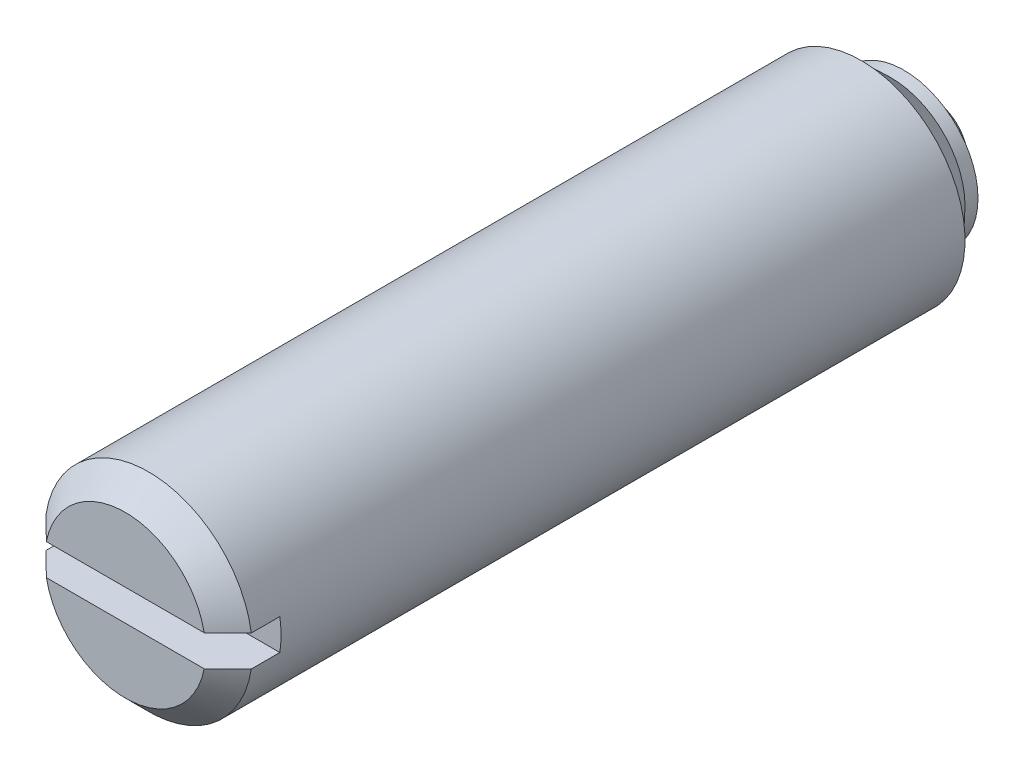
ISO-10303-21;
HEADER;
FILE_DESCRIPTION(('STEP AP214'),'2;1');
FILE_NAME('part.step','',(''),(''),'','','');
FILE_SCHEMA(('AUTOMOTIVE_DESIGN { 1 0 10303 214 1 1 1 1 }'));
ENDSEC;
DATA;
#1=APPLICATION_CONTEXT('core data for automotive mechanical design processes');
#2=APPLICATION_PROTOCOL_DEFINITION('international standard','automotive_design',2000,#1);
#3=PRODUCT_CONTEXT('',#1,'mechanical');
#4=PRODUCT('Part','Part','',(#3));
#5=PRODUCT_RELATED_PRODUCT_CATEGORY('part','',(#4));
#6=PRODUCT_DEFINITION_FORMATION('','',#4);
#7=PRODUCT_DEFINITION_CONTEXT('part definition',#1,'design');
#8=PRODUCT_DEFINITION('design','',#6,#7);
#9=PRODUCT_DEFINITION_SHAPE('','',#8);
#10=(LENGTH_UNIT() NAMED_UNIT(*) SI_UNIT(.MILLI.,.METRE.));
#11=(NAMED_UNIT(*) PLANE_ANGLE_UNIT() SI_UNIT($,.RADIAN.));
#12=(NAMED_UNIT(*) SI_UNIT($,.STERADIAN.) SOLID_ANGLE_UNIT());
#13=UNCERTAINTY_MEASURE_WITH_UNIT(LENGTH_MEASURE(1.E-05),#10,'distance_accuracy_value','');
#14=(GEOMETRIC_REPRESENTATION_CONTEXT(3) GLOBAL_UNCERTAINTY_ASSIGNED_CONTEXT((#13)) GLOBAL_UNIT_ASSIGNED_CONTEXT((#10,
#11,#12)) REPRESENTATION_CONTEXT('',''));
#15=CARTESIAN_POINT('',(0.,0.,0.));
#16=DIRECTION('',(0.,0.,1.));
#17=DIRECTION('',(1.,0.,0.));
#18=AXIS2_PLACEMENT_3D('',#15,#16,#17);
#19=CARTESIAN_POINT('',(0.,0.,1.5));
#20=DIRECTION('',(0.,0.,-1.));
#21=DIRECTION('',(-1.,0.,0.));
#22=AXIS2_PLACEMENT_3D('',#19,#20,#21);
#23=PLANE('',#22);
#24=CARTESIAN_POINT('',(0.,0.,1.5));
#25=DIRECTION('',(0.,0.,-1.));
#26=DIRECTION('',(-1.,0.,0.));
#27=AXIS2_PLACEMENT_3D('',#24,#25,#26);
#28=CIRCLE('',#27,2.29128784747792);
#29=CARTESIAN_POINT('',(-2.29128784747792,0.,1.5));
#30=VERTEX_POINT('',#29);
#31=EDGE_CURVE('E103',#30,#30,#28,.T.);
#32=ORIENTED_EDGE('',*,*,#31,.F.);
#33=EDGE_LOOP('',(#32));
#34=FACE_BOUND('',#33,.T.);
#35=CARTESIAN_POINT('',(0.,0.,1.5));
#36=DIRECTION('',(0.,0.,1.));
#37=DIRECTION('',(1.,0.,0.));
#38=AXIS2_PLACEMENT_3D('',#35,#36,#37);
#39=CIRCLE('',#38,2.85);
#40=CARTESIAN_POINT('',(2.85,0.,1.5));
#41=VERTEX_POINT('',#40);
#42=EDGE_CURVE('E104',#41,#41,#39,.T.);
#43=ORIENTED_EDGE('',*,*,#42,.F.);
#44=EDGE_LOOP('',(#43));
#45=FACE_BOUND('',#44,.T.);
#46=ADVANCED_FACE('F14',(#34,#45),#23,.T.);
#47=CARTESIAN_POINT('',(0.,0.,2.5));
#48=DIRECTION('',(0.,0.,-1.));
#49=DIRECTION('',(1.,0.,0.));
#50=AXIS2_PLACEMENT_3D('',#47,#48,#49);
#51=SPHERICAL_SURFACE('',#50,2.5);
#52=ORIENTED_EDGE('',*,*,#31,.T.);
#53=EDGE_LOOP('',(#52));
#54=FACE_BOUND('',#53,.T.);
#55=ADVANCED_FACE('F185',(#54),#51,.T.);
#56=CARTESIAN_POINT('',(0.,0.,34.6389562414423));
#57=DIRECTION('',(0.,0.,1.));
#58=DIRECTION('',(1.,0.,0.));
#59=AXIS2_PLACEMENT_3D('',#56,#57,#58);
#60=CYLINDRICAL_SURFACE('',#59,2.85);
#61=ORIENTED_EDGE('',*,*,#42,.T.);
#62=EDGE_LOOP('',(#61));
#63=FACE_BOUND('',#62,.T.);
#64=CARTESIAN_POINT('',(0.,0.,2.));
#65=DIRECTION('',(0.,0.,1.));
#66=DIRECTION('',(1.,0.,0.));
#67=AXIS2_PLACEMENT_3D('',#64,#65,#66);
#68=CIRCLE('',#67,2.85);
#69=CARTESIAN_POINT('',(2.85,0.,2.));
#70=VERTEX_POINT('',#69);
#71=EDGE_CURVE('E164',#70,#70,#68,.T.);
#72=ORIENTED_EDGE('',*,*,#71,.F.);
#73=EDGE_LOOP('',(#72));
#74=FACE_BOUND('',#73,.T.);
#75=ADVANCED_FACE('F175',(#63,#74),#60,.T.);
#76=CARTESIAN_POINT('',(0.,0.,3.15));
#77=DIRECTION('',(0.,0.,1.));
#78=DIRECTION('',(1.,0.,0.));
#79=AXIS2_PLACEMENT_3D('',#76,#77,#78);
#80=CONICAL_SURFACE('',#79,3.9433307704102,0.760142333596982);
#81=ORIENTED_EDGE('',*,*,#71,.T.);
#82=EDGE_LOOP('',(#81));
#83=FACE_BOUND('',#82,.T.);
#84=CARTESIAN_POINT('',(0.,0.,3.15));
#85=DIRECTION('',(0.,0.,1.));
#86=DIRECTION('',(1.,0.,0.));
#87=AXIS2_PLACEMENT_3D('',#84,#85,#86);
#88=CIRCLE('',#87,3.9433307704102);
#89=CARTESIAN_POINT('',(3.9433307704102,0.,3.15));
#90=VERTEX_POINT('',#89);
#91=EDGE_CURVE('E167',#90,#90,#88,.T.);
#92=ORIENTED_EDGE('',*,*,#91,.F.);
#93=EDGE_LOOP('',(#92));
#94=FACE_BOUND('',#93,.T.);
#95=ADVANCED_FACE('F173',(#83,#94),#80,.T.);
#96=CARTESIAN_POINT('',(0.,3.9433307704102,3.15));
#97=DIRECTION('',(0.,0.,-1.));
#98=DIRECTION('',(-1.,0.,0.));
#99=AXIS2_PLACEMENT_3D('',#96,#97,#98);
#100=PLANE('',#99);
#101=CARTESIAN_POINT('',(0.,0.,3.15));
#102=DIRECTION('',(0.,0.,-1.));
#103=DIRECTION('',(-1.,0.,0.));
#104=AXIS2_PLACEMENT_3D('',#101,#102,#103);
#105=CIRCLE('',#104,4.);
#106=CARTESIAN_POINT('',(-4.,0.,3.15));
#107=VERTEX_POINT('',#106);
#108=EDGE_CURVE('E100',#107,#107,#105,.F.);
#109=ORIENTED_EDGE('',*,*,#108,.F.);
#110=EDGE_LOOP('',(#109));
#111=FACE_BOUND('',#110,.T.);
#112=ORIENTED_EDGE('',*,*,#91,.T.);
#113=EDGE_LOOP('',(#112));
#114=FACE_BOUND('',#113,.T.);
#115=ADVANCED_FACE('F171',(#111,#114),#100,.T.);
#116=CARTESIAN_POINT('',(0.,4.,31.5));
#117=DIRECTION('',(0.,0.,1.));
#118=DIRECTION('',(1.,0.,0.));
#119=AXIS2_PLACEMENT_3D('',#116,#117,#118);
#120=PLANE('',#119);
#121=DIRECTION('',(1.,0.,0.));
#122=VECTOR('',#121,1.);
#123=CARTESIAN_POINT('',(-3.95474398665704,-0.6,31.5));
#124=LINE('',#123,#122);
#125=CARTESIAN_POINT('',(-3.04138126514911,-0.6,31.5));
#126=VERTEX_POINT('',#125);
#127=CARTESIAN_POINT('',(3.04138126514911,-0.6,31.5));
#128=VERTEX_POINT('',#127);
#129=EDGE_CURVE('E153',#126,#128,#124,.T.);
#130=ORIENTED_EDGE('',*,*,#129,.F.);
#131=CARTESIAN_POINT('',(0.,0.,31.5));
#132=DIRECTION('',(0.,0.,1.));
#133=DIRECTION('',(1.,0.,0.));
#134=AXIS2_PLACEMENT_3D('',#131,#132,#133);
#135=CIRCLE('',#134,3.1);
#136=EDGE_CURVE('E147',#126,#128,#135,.T.);
#137=ORIENTED_EDGE('',*,*,#136,.T.);
#138=EDGE_LOOP('',(#130,#137));
#139=FACE_BOUND('',#138,.T.);
#140=ADVANCED_FACE('F129',(#139),#120,.T.);
#141=CARTESIAN_POINT('',(-3.95474398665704,-0.6,29.5));
#142=DIRECTION('',(0.,-1.,0.));
#143=DIRECTION('',(1.,0.,0.));
#144=AXIS2_PLACEMENT_3D('',#141,#142,#143);
#145=PLANE('',#144);
#146=DIRECTION('',(0.,0.,1.));
#147=VECTOR('',#146,1.);
#148=CARTESIAN_POINT('',(-3.95474398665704,-0.6,29.5));
#149=LINE('',#148,#147);
#150=CARTESIAN_POINT('',(-3.95474398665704,-0.6,29.5));
#151=VERTEX_POINT('',#150);
#152=CARTESIAN_POINT('',(-3.95474398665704,-0.6,30.6));
#153=VERTEX_POINT('',#152);
#154=EDGE_CURVE('E81',#151,#153,#149,.T.);
#155=ORIENTED_EDGE('',*,*,#154,.T.);
#156=CARTESIAN_POINT('',(-3.95474398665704,-0.6,30.6));
#157=CARTESIAN_POINT('',(-3.87875606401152,-0.6,30.6751274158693));
#158=CARTESIAN_POINT('',(-3.80274454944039,-0.6,30.7502309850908));
#159=CARTESIAN_POINT('',(-3.65066332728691,-0.6,30.9003790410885));
#160=CARTESIAN_POINT('',(-3.57459361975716,-0.6,30.9754235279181));
#161=CARTESIAN_POINT('',(-3.42238484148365,-0.6,31.125442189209));
#162=CARTESIAN_POINT('',(-3.34624577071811,-0.6,31.2004163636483));
#163=CARTESIAN_POINT('',(-3.19388188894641,-0.6,31.3502776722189));
#164=CARTESIAN_POINT('',(-3.11765707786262,-0.6,31.4251648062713));
#165=CARTESIAN_POINT('',(-3.04138126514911,-0.6,31.5));
#166=B_SPLINE_CURVE_WITH_KNOTS('',3,(#156,#157,#158,#159,#160,#161,#162,#163,#164,#165),
.UNSPECIFIED.,.F.,.F.,(4,2,2,2,4),(0.,0.320569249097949,0.641138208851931,0.961707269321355,
1.28227662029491),.UNSPECIFIED.);
#167=EDGE_CURVE('E115',#153,#126,#166,.T.);
#168=ORIENTED_EDGE('',*,*,#167,.T.);
#169=ORIENTED_EDGE('',*,*,#129,.T.);
#170=CARTESIAN_POINT('',(3.04138126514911,-0.6,31.5));
#171=CARTESIAN_POINT('',(3.11765707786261,-0.6,31.4251648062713));
#172=CARTESIAN_POINT('',(3.19388188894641,-0.6,31.3502776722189));
#173=CARTESIAN_POINT('',(3.34624577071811,-0.6,31.2004163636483));
#174=CARTESIAN_POINT('',(3.42238484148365,-0.6,31.125442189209));
#175=CARTESIAN_POINT('',(3.57459361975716,-0.6,30.9754235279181));
#176=CARTESIAN_POINT('',(3.65066332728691,-0.6,30.9003790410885));
#177=CARTESIAN_POINT('',(3.80274454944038,-0.6,30.7502309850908));
#178=CARTESIAN_POINT('',(3.87875606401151,-0.6,30.6751274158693));
#179=CARTESIAN_POINT('',(3.95474398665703,-0.6,30.6));
#180=B_SPLINE_CURVE_WITH_KNOTS('',3,(#170,#171,#172,#173,#174,#175,#176,#177,#178,#179),
.UNSPECIFIED.,.F.,.F.,(4,2,2,2,4),(0.,0.320569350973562,0.641138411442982,0.961707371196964,
1.28227662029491),.UNSPECIFIED.);
#181=CARTESIAN_POINT('',(3.95474398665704,-0.6,30.6));
#182=VERTEX_POINT('',#181);
#183=EDGE_CURVE('E108',#128,#182,#180,.T.);
#184=ORIENTED_EDGE('',*,*,#183,.T.);
#185=DIRECTION('',(0.,0.,1.));
#186=VECTOR('',#185,1.);
#187=CARTESIAN_POINT('',(3.95474398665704,-0.6,29.5));
#188=LINE('',#187,#186);
#189=CARTESIAN_POINT('',(3.95474398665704,-0.6,29.5));
#190=VERTEX_POINT('',#189);
#191=EDGE_CURVE('E83',#190,#182,#188,.T.);
#192=ORIENTED_EDGE('',*,*,#191,.F.);
#193=DIRECTION('',(1.,0.,0.));
#194=VECTOR('',#193,1.);
#195=CARTESIAN_POINT('',(-3.95474398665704,-0.6,29.5));
#196=LINE('',#195,#194);
#197=EDGE_CURVE('E68',#151,#190,#196,.T.);
#198=ORIENTED_EDGE('',*,*,#197,.F.);
#199=EDGE_LOOP('',(#155,#168,#169,#184,#192,#198));
#200=FACE_BOUND('',#199,.T.);
#201=ADVANCED_FACE('F80',(#200),#145,.F.);
#202=DIRECTION('',(1.,0.,0.));
#203=VECTOR('',#202,1.);
#204=CARTESIAN_POINT('',(-3.95474398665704,0.6,31.5));
#205=LINE('',#204,#203);
#206=CARTESIAN_POINT('',(-3.04138126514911,0.6,31.5));
#207=VERTEX_POINT('',#206);
#208=CARTESIAN_POINT('',(3.04138126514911,0.6,31.5));
#209=VERTEX_POINT('',#208);
#210=EDGE_CURVE('E75',#207,#209,#205,.T.);
#211=ORIENTED_EDGE('',*,*,#210,.T.);
#212=CARTESIAN_POINT('',(0.,0.,31.5));
#213=DIRECTION('',(0.,0.,1.));
#214=DIRECTION('',(1.,0.,0.));
#215=AXIS2_PLACEMENT_3D('',#212,#213,#214);
#216=CIRCLE('',#215,3.1);
#217=EDGE_CURVE('E9',#209,#207,#216,.T.);
#218=ORIENTED_EDGE('',*,*,#217,.T.);
#219=EDGE_LOOP('',(#211,#218));
#220=FACE_BOUND('',#219,.T.);
#221=ADVANCED_FACE('F128',(#220),#120,.T.);
#222=CARTESIAN_POINT('',(-3.95474398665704,0.6,29.5));
#223=DIRECTION('',(0.,-1.,0.));
#224=DIRECTION('',(1.,0.,0.));
#225=AXIS2_PLACEMENT_3D('',#222,#223,#224);
#226=PLANE('',#225);
#227=DIRECTION('',(0.,0.,1.));
#228=VECTOR('',#227,1.);
#229=CARTESIAN_POINT('',(3.95474398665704,0.6,29.5));
#230=LINE('',#229,#228);
#231=CARTESIAN_POINT('',(3.95474398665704,0.6,29.5));
#232=VERTEX_POINT('',#231);
#233=CARTESIAN_POINT('',(3.95474398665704,0.6,30.6));
#234=VERTEX_POINT('',#233);
#235=EDGE_CURVE('E92',#232,#234,#230,.T.);
#236=ORIENTED_EDGE('',*,*,#235,.T.);
#237=CARTESIAN_POINT('',(3.95474398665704,0.6,30.6));
#238=CARTESIAN_POINT('',(3.87875606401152,0.6,30.6751274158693));
#239=CARTESIAN_POINT('',(3.80274454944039,0.6,30.7502309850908));
#240=CARTESIAN_POINT('',(3.65066332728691,0.6,30.9003790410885));
#241=CARTESIAN_POINT('',(3.57459361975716,0.6,30.9754235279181));
#242=CARTESIAN_POINT('',(3.42238484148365,0.6,31.125442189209));
#243=CARTESIAN_POINT('',(3.34624577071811,0.6,31.2004163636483));
#244=CARTESIAN_POINT('',(3.19388188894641,0.6,31.3502776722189));
#245=CARTESIAN_POINT('',(3.11765707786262,0.6,31.4251648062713));
#246=CARTESIAN_POINT('',(3.04138126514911,0.6,31.5));
#247=B_SPLINE_CURVE_WITH_KNOTS('',3,(#237,#238,#239,#240,#241,#242,#243,#244,#245,#246),
.UNSPECIFIED.,.F.,.F.,(4,2,2,2,4),(0.,0.320569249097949,0.641138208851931,0.961707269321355,
1.28227662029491),.UNSPECIFIED.);
#248=EDGE_CURVE('E23',#234,#209,#247,.T.);
#249=ORIENTED_EDGE('',*,*,#248,.T.);
#250=ORIENTED_EDGE('',*,*,#210,.F.);
#251=CARTESIAN_POINT('',(-3.04138126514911,0.6,31.5));
#252=CARTESIAN_POINT('',(-3.11765707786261,0.6,31.4251648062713));
#253=CARTESIAN_POINT('',(-3.19388188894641,0.6,31.3502776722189));
#254=CARTESIAN_POINT('',(-3.34624577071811,0.6,31.2004163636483));
#255=CARTESIAN_POINT('',(-3.42238484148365,0.6,31.125442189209));
#256=CARTESIAN_POINT('',(-3.57459361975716,0.6,30.9754235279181));
#257=CARTESIAN_POINT('',(-3.65066332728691,0.6,30.9003790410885));
#258=CARTESIAN_POINT('',(-3.80274454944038,0.6,30.7502309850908));
#259=CARTESIAN_POINT('',(-3.87875606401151,0.6,30.6751274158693));
#260=CARTESIAN_POINT('',(-3.95474398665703,0.6,30.6));
#261=B_SPLINE_CURVE_WITH_KNOTS('',3,(#251,#252,#253,#254,#255,#256,#257,#258,#259,#260),
.UNSPECIFIED.,.F.,.F.,(4,2,2,2,4),(0.,0.320569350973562,0.641138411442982,0.961707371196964,
1.28227662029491),.UNSPECIFIED.);
#262=CARTESIAN_POINT('',(-3.95474398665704,0.6,30.6));
#263=VERTEX_POINT('',#262);
#264=EDGE_CURVE('E138',#207,#263,#261,.T.);
#265=ORIENTED_EDGE('',*,*,#264,.T.);
#266=DIRECTION('',(0.,0.,1.));
#267=VECTOR('',#266,1.);
#268=CARTESIAN_POINT('',(-3.95474398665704,0.6,29.5));
#269=LINE('',#268,#267);
#270=CARTESIAN_POINT('',(-3.95474398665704,0.6,29.5));
#271=VERTEX_POINT('',#270);
#272=EDGE_CURVE('E97',#271,#263,#269,.T.);
#273=ORIENTED_EDGE('',*,*,#272,.F.);
#274=DIRECTION('',(1.,0.,0.));
#275=VECTOR('',#274,1.);
#276=CARTESIAN_POINT('',(-3.95474398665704,0.6,29.5));
#277=LINE('',#276,#275);
#278=EDGE_CURVE('E71',#271,#232,#277,.T.);
#279=ORIENTED_EDGE('',*,*,#278,.T.);
#280=EDGE_LOOP('',(#236,#249,#250,#265,#273,#279));
#281=FACE_BOUND('',#280,.T.);
#282=ADVANCED_FACE('F131',(#281),#226,.T.);
#283=CARTESIAN_POINT('',(0.,0.,29.5));
#284=DIRECTION('',(0.,0.,1.));
#285=DIRECTION('',(1.,0.,0.));
#286=AXIS2_PLACEMENT_3D('',#283,#284,#285);
#287=PLANE('',#286);
#288=CARTESIAN_POINT('',(0.,0.,29.5));
#289=DIRECTION('',(0.,0.,1.));
#290=DIRECTION('',(1.,0.,0.));
#291=AXIS2_PLACEMENT_3D('',#288,#289,#290);
#292=CIRCLE('',#291,4.);
#293=EDGE_CURVE('E65',#271,#151,#292,.T.);
#294=ORIENTED_EDGE('',*,*,#293,.T.);
#295=ORIENTED_EDGE('',*,*,#197,.T.);
#296=EDGE_CURVE('E77',#190,#232,#292,.T.);
#297=ORIENTED_EDGE('',*,*,#296,.T.);
#298=ORIENTED_EDGE('',*,*,#278,.F.);
#299=EDGE_LOOP('',(#294,#295,#297,#298));
#300=FACE_BOUND('',#299,.T.);
#301=ADVANCED_FACE('F67',(#300),#287,.T.);
#302=CARTESIAN_POINT('',(0.,0.,11.5));
#303=DIRECTION('',(0.,0.,-1.));
#304=DIRECTION('',(-1.,0.,0.));
#305=AXIS2_PLACEMENT_3D('',#302,#303,#304);
#306=CYLINDRICAL_SURFACE('',#305,4.);
#307=ORIENTED_EDGE('',*,*,#191,.T.);
#308=CARTESIAN_POINT('',(0.,0.,30.6));
#309=DIRECTION('',(0.,0.,1.));
#310=DIRECTION('',(1.,0.,0.));
#311=AXIS2_PLACEMENT_3D('',#308,#309,#310);
#312=CIRCLE('',#311,4.);
#313=EDGE_CURVE('E90',#182,#153,#312,.F.);
#314=ORIENTED_EDGE('',*,*,#313,.T.);
#315=ORIENTED_EDGE('',*,*,#154,.F.);
#316=ORIENTED_EDGE('',*,*,#293,.F.);
#317=ORIENTED_EDGE('',*,*,#272,.T.);
#318=CARTESIAN_POINT('',(0.,0.,30.6));
#319=DIRECTION('',(0.,0.,1.));
#320=DIRECTION('',(1.,0.,0.));
#321=AXIS2_PLACEMENT_3D('',#318,#319,#320);
#322=CIRCLE('',#321,4.);
#323=EDGE_CURVE('E99',#263,#234,#322,.F.);
#324=ORIENTED_EDGE('',*,*,#323,.T.);
#325=ORIENTED_EDGE('',*,*,#235,.F.);
#326=ORIENTED_EDGE('',*,*,#296,.F.);
#327=EDGE_LOOP('',(#307,#314,#315,#316,#317,#324,#325,#326));
#328=FACE_BOUND('',#327,.T.);
#329=ORIENTED_EDGE('',*,*,#108,.T.);
#330=EDGE_LOOP('',(#329));
#331=FACE_BOUND('',#330,.T.);
#332=ADVANCED_FACE('F87',(#328,#331),#306,.T.);
#333=CARTESIAN_POINT('',(0.,0.,30.6));
#334=DIRECTION('',(0.,0.,-1.));
#335=DIRECTION('',(-1.,0.,0.));
#336=AXIS2_PLACEMENT_3D('',#333,#334,#335);
#337=CONICAL_SURFACE('',#336,4.,0.78539816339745);
#338=ORIENTED_EDGE('',*,*,#183,.F.);
#339=ORIENTED_EDGE('',*,*,#136,.F.);
#340=ORIENTED_EDGE('',*,*,#167,.F.);
#341=ORIENTED_EDGE('',*,*,#313,.F.);
#342=EDGE_LOOP('',(#338,#339,#340,#341));
#343=FACE_BOUND('',#342,.T.);
#344=ADVANCED_FACE('F121',(#343),#337,.T.);
#345=CARTESIAN_POINT('',(0.,0.,30.6));
#346=DIRECTION('',(0.,0.,-1.));
#347=DIRECTION('',(-1.,0.,0.));
#348=AXIS2_PLACEMENT_3D('',#345,#346,#347);
#349=CONICAL_SURFACE('',#348,4.,0.78539816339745);
#350=ORIENTED_EDGE('',*,*,#264,.F.);
#351=ORIENTED_EDGE('',*,*,#217,.F.);
#352=ORIENTED_EDGE('',*,*,#248,.F.);
#353=ORIENTED_EDGE('',*,*,#323,.F.);
#354=EDGE_LOOP('',(#350,#351,#352,#353));
#355=FACE_BOUND('',#354,.T.);
#356=ADVANCED_FACE('F16',(#355),#349,.T.);
#357=CLOSED_SHELL('',(#46,#55,#75,#95,#115,#140,#201,#221,#282,#301,#332,#344,#356));
#358=MANIFOLD_SOLID_BREP('B1',#357);
#359=ADVANCED_BREP_SHAPE_REPRESENTATION('',(#18,#358),#14);
#360=SHAPE_DEFINITION_REPRESENTATION(#9,#359);
ENDSEC;
END-ISO-10303-21;
